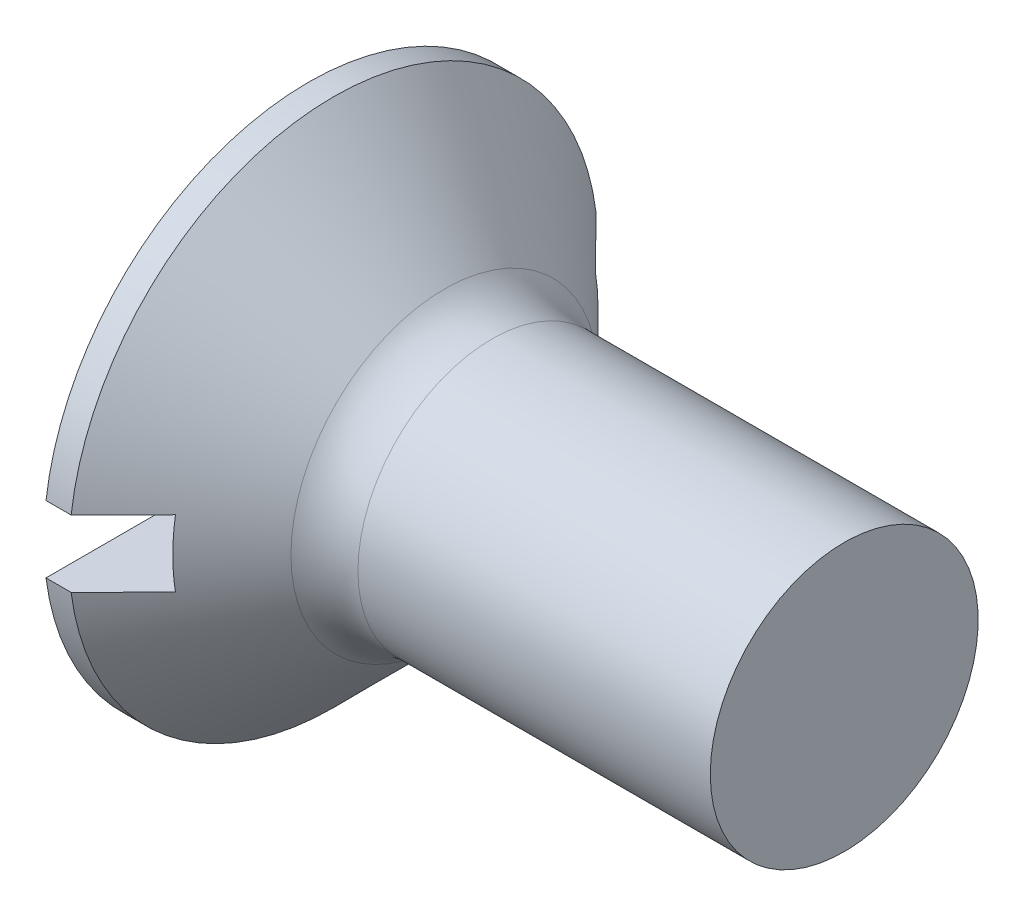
ISO-10303-21;
HEADER;
FILE_DESCRIPTION(('STEP AP214'),'2;1');
FILE_NAME('part.step','',(''),(''),'','','');
FILE_SCHEMA(('AUTOMOTIVE_DESIGN { 1 0 10303 214 1 1 1 1 }'));
ENDSEC;
DATA;
#1=APPLICATION_CONTEXT('core data for automotive mechanical design processes');
#2=APPLICATION_PROTOCOL_DEFINITION('international standard','automotive_design',2000,#1);
#3=PRODUCT_CONTEXT('',#1,'mechanical');
#4=PRODUCT('Part','Part','',(#3));
#5=PRODUCT_RELATED_PRODUCT_CATEGORY('part','',(#4));
#6=PRODUCT_DEFINITION_FORMATION('','',#4);
#7=PRODUCT_DEFINITION_CONTEXT('part definition',#1,'design');
#8=PRODUCT_DEFINITION('design','',#6,#7);
#9=PRODUCT_DEFINITION_SHAPE('','',#8);
#10=(LENGTH_UNIT() NAMED_UNIT(*) SI_UNIT(.MILLI.,.METRE.));
#11=(NAMED_UNIT(*) PLANE_ANGLE_UNIT() SI_UNIT($,.RADIAN.));
#12=(NAMED_UNIT(*) SI_UNIT($,.STERADIAN.) SOLID_ANGLE_UNIT());
#13=UNCERTAINTY_MEASURE_WITH_UNIT(LENGTH_MEASURE(1.E-05),#10,'distance_accuracy_value','');
#14=(GEOMETRIC_REPRESENTATION_CONTEXT(3) GLOBAL_UNCERTAINTY_ASSIGNED_CONTEXT((#13)) GLOBAL_UNIT_ASSIGNED_CONTEXT((#10,
#11,#12)) REPRESENTATION_CONTEXT('',''));
#15=CARTESIAN_POINT('',(0.,0.,0.));
#16=DIRECTION('',(0.,0.,1.));
#17=DIRECTION('',(1.,0.,0.));
#18=AXIS2_PLACEMENT_3D('',#15,#16,#17);
#19=CARTESIAN_POINT('',(0.,0.,0.));
#20=DIRECTION('',(-1.,0.,0.));
#21=DIRECTION('',(0.,0.,1.));
#22=AXIS2_PLACEMENT_3D('',#19,#20,#21);
#23=PLANE('',#22);
#24=DIRECTION('',(0.,0.,-1.));
#25=VECTOR('',#24,1.);
#26=CARTESIAN_POINT('',(0.,1.,7.90000000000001));
#27=LINE('',#26,#25);
#28=CARTESIAN_POINT('',(0.,0.999999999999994,7.83645327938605));
#29=VERTEX_POINT('',#28);
#30=CARTESIAN_POINT('',(0.,0.999999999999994,-7.83645327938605));
#31=VERTEX_POINT('',#30);
#32=EDGE_CURVE('E170',#29,#31,#27,.T.);
#33=ORIENTED_EDGE('',*,*,#32,.F.);
#34=CARTESIAN_POINT('',(0.,0.,0.));
#35=DIRECTION('',(-1.,0.,0.));
#36=DIRECTION('',(0.,0.,1.));
#37=AXIS2_PLACEMENT_3D('',#34,#35,#36);
#38=CIRCLE('',#37,7.9);
#39=EDGE_CURVE('E115',#29,#31,#38,.T.);
#40=ORIENTED_EDGE('',*,*,#39,.T.);
#41=EDGE_LOOP('',(#33,#40));
#42=FACE_BOUND('',#41,.T.);
#43=ADVANCED_FACE('F34',(#42),#23,.T.);
#44=CARTESIAN_POINT('',(-6.34999999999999,0.,0.));
#45=DIRECTION('',(-1.,0.,0.));
#46=DIRECTION('',(0.,0.,1.));
#47=AXIS2_PLACEMENT_3D('',#44,#45,#46);
#48=CYLINDRICAL_SURFACE('',#47,7.9);
#49=DIRECTION('',(-1.,0.,0.));
#50=VECTOR('',#49,1.);
#51=CARTESIAN_POINT('',(-6.34999999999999,0.999999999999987,-7.83645327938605));
#52=LINE('',#51,#50);
#53=CARTESIAN_POINT('',(0.750000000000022,0.999999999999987,-7.83645327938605));
#54=VERTEX_POINT('',#53);
#55=EDGE_CURVE('E62',#31,#54,#52,.F.);
#56=ORIENTED_EDGE('',*,*,#55,.F.);
#57=ORIENTED_EDGE('',*,*,#39,.F.);
#58=DIRECTION('',(-1.,0.,0.));
#59=VECTOR('',#58,1.);
#60=CARTESIAN_POINT('',(-6.34999999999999,0.999999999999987,7.83645327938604));
#61=LINE('',#60,#59);
#62=CARTESIAN_POINT('',(0.750000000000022,0.999999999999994,7.83645327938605));
#63=VERTEX_POINT('',#62);
#64=EDGE_CURVE('E176',#63,#29,#61,.T.);
#65=ORIENTED_EDGE('',*,*,#64,.F.);
#66=CARTESIAN_POINT('',(0.750000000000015,0.,0.));
#67=DIRECTION('',(-1.,0.,0.));
#68=DIRECTION('',(0.,0.,1.));
#69=AXIS2_PLACEMENT_3D('',#66,#67,#68);
#70=CIRCLE('',#69,7.9);
#71=EDGE_CURVE('E109',#63,#54,#70,.T.);
#72=ORIENTED_EDGE('',*,*,#71,.T.);
#73=EDGE_LOOP('',(#56,#57,#65,#72));
#74=FACE_BOUND('',#73,.T.);
#75=ADVANCED_FACE('F157',(#74),#48,.T.);
#76=DIRECTION('',(0.,0.,1.));
#77=VECTOR('',#76,1.);
#78=CARTESIAN_POINT('',(0.,-1.00000000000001,-7.90000000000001));
#79=LINE('',#78,#77);
#80=CARTESIAN_POINT('',(0.,-1.00000000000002,-7.83645327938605));
#81=VERTEX_POINT('',#80);
#82=CARTESIAN_POINT('',(0.,-1.00000000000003,7.83645327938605));
#83=VERTEX_POINT('',#82);
#84=EDGE_CURVE('E103',#81,#83,#79,.T.);
#85=ORIENTED_EDGE('',*,*,#84,.F.);
#86=EDGE_CURVE('E111',#81,#83,#38,.T.);
#87=ORIENTED_EDGE('',*,*,#86,.T.);
#88=EDGE_LOOP('',(#85,#87));
#89=FACE_BOUND('',#88,.T.);
#90=ADVANCED_FACE('F36',(#89),#23,.T.);
#91=DIRECTION('',(-1.,0.,0.));
#92=VECTOR('',#91,1.);
#93=CARTESIAN_POINT('',(-6.34999999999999,-1.00000000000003,7.83645327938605));
#94=LINE('',#93,#92);
#95=CARTESIAN_POINT('',(0.750000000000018,-1.00000000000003,7.83645327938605));
#96=VERTEX_POINT('',#95);
#97=EDGE_CURVE('E175',#83,#96,#94,.F.);
#98=ORIENTED_EDGE('',*,*,#97,.F.);
#99=ORIENTED_EDGE('',*,*,#86,.F.);
#100=DIRECTION('',(-1.,0.,0.));
#101=VECTOR('',#100,1.);
#102=CARTESIAN_POINT('',(-6.34999999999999,-1.00000000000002,-7.83645327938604));
#103=LINE('',#102,#101);
#104=CARTESIAN_POINT('',(0.750000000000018,-1.00000000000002,-7.83645327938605));
#105=VERTEX_POINT('',#104);
#106=EDGE_CURVE('E173',#105,#81,#103,.T.);
#107=ORIENTED_EDGE('',*,*,#106,.F.);
#108=EDGE_CURVE('E112',#105,#96,#70,.T.);
#109=ORIENTED_EDGE('',*,*,#108,.T.);
#110=EDGE_LOOP('',(#98,#99,#107,#109));
#111=FACE_BOUND('',#110,.T.);
#112=ADVANCED_FACE('F154',(#111),#48,.T.);
#113=CARTESIAN_POINT('',(0.750000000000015,0.,0.));
#114=DIRECTION('',(-1.,0.,0.));
#115=DIRECTION('',(0.,0.,1.));
#116=AXIS2_PLACEMENT_3D('',#113,#114,#115);
#117=CONICAL_SURFACE('',#116,7.9,0.78539816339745);
#118=CARTESIAN_POINT('',(-8.7757078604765,0.999999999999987,-17.3969909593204));
#119=CARTESIAN_POINT('',(-8.18516126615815,1.,-16.8054622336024));
#120=CARTESIAN_POINT('',(-7.59465740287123,1.00000000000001,-16.2138908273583));
#121=CARTESIAN_POINT('',(-6.41378164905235,1.00000000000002,-15.0306023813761));
#122=CARTESIAN_POINT('',(-5.82340976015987,1.00000000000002,-14.4388853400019));
#123=CARTESIAN_POINT('',(-4.64270263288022,1.00000000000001,-13.255103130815));
#124=CARTESIAN_POINT('',(-4.05236744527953,1.00000000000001,-12.6630379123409));
#125=CARTESIAN_POINT('',(-2.87199614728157,1.00000000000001,-11.478622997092));
#126=CARTESIAN_POINT('',(-2.28196003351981,1.00000000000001,-10.8862733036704));
#127=CARTESIAN_POINT('',(-1.08164284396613,1.00000000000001,-9.68031352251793));
#128=CARTESIAN_POINT('',(-0.471378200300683,1.00000000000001,-9.06668707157));
#129=CARTESIAN_POINT('',(0.44335636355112,1.00000000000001,-8.14556750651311));
#130=CARTESIAN_POINT('',(0.748162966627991,1.00000000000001,-7.83840880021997));
#131=CARTESIAN_POINT('',(1.35745269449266,1.00000000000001,-7.2237728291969));
#132=CARTESIAN_POINT('',(1.66193582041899,1.00000000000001,-6.91629556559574));
#133=CARTESIAN_POINT('',(2.27038024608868,1.00000000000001,-6.30092705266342));
#134=CARTESIAN_POINT('',(2.57434162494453,1.00000000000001,-5.99303588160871));
#135=CARTESIAN_POINT('',(3.18153118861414,1.00000000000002,-5.37652314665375));
#136=CARTESIAN_POINT('',(3.48475936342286,1.00000000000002,-5.06790157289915));
#137=CARTESIAN_POINT('',(4.0899815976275,1.00000000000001,-4.44948585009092));
#138=CARTESIAN_POINT('',(4.39197573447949,1.00000000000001,-4.13969177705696));
#139=CARTESIAN_POINT('',(4.84320779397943,1.00000000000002,-3.67330421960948));
#140=CARTESIAN_POINT('',(4.99332367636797,1.00000000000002,-3.51756065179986));
#141=CARTESIAN_POINT('',(5.29268613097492,1.00000000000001,-3.20524073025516));
#142=CARTESIAN_POINT('',(5.44193271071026,0.999999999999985,-3.04866438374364));
#143=CARTESIAN_POINT('',(5.63045968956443,1.00000000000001,-2.84917706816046));
#144=CARTESIAN_POINT('',(5.6703639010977,1.00000000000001,-2.8068555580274));
#145=CARTESIAN_POINT('',(5.7500596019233,1.00000000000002,-2.72210635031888));
#146=CARTESIAN_POINT('',(5.78985109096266,1.00000000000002,-2.67967865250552));
#147=CARTESIAN_POINT('',(5.90903474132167,1.00000000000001,-2.55221478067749));
#148=CARTESIAN_POINT('',(5.98823500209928,1.00000000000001,-2.46699897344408));
#149=CARTESIAN_POINT('',(6.14568357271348,1.00000000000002,-2.29623493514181));
#150=CARTESIAN_POINT('',(6.22393422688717,1.00000000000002,-2.21068887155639));
#151=CARTESIAN_POINT('',(6.37949659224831,1.00000000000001,-2.03875368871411));
#152=CARTESIAN_POINT('',(6.45680833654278,1.,-1.95236459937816));
#153=CARTESIAN_POINT('',(6.63613457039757,0.999999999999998,-1.74892660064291));
#154=CARTESIAN_POINT('',(6.737633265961,1.00000000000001,-1.6314172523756));
#155=CARTESIAN_POINT('',(6.8871116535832,1.00000000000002,-1.45218704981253));
#156=CARTESIAN_POINT('',(6.93662933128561,1.00000000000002,-1.39175212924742));
#157=CARTESIAN_POINT('',(7.03419733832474,1.00000000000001,-1.26971270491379));
#158=CARTESIAN_POINT('',(7.08224781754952,0.999999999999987,-1.20810832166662));
#159=CARTESIAN_POINT('',(7.17686733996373,0.999999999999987,-1.08252063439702));
#160=CARTESIAN_POINT('',(7.2234095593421,1.00000000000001,-1.01851697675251));
#161=CARTESIAN_POINT('',(7.31335312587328,1.00000000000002,-0.888176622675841));
#162=CARTESIAN_POINT('',(7.35675018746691,1.00000000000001,-0.821836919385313));
#163=CARTESIAN_POINT('',(7.43812345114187,1.00000000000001,-0.686691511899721));
#164=CARTESIAN_POINT('',(7.47614561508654,1.00000000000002,-0.617913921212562));
#165=CARTESIAN_POINT('',(7.54401836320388,1.00000000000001,-0.476459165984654));
#166=CARTESIAN_POINT('',(7.57389424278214,0.999999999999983,-0.40379493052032));
#167=CARTESIAN_POINT('',(7.60791308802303,0.999999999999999,-0.294944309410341));
#168=CARTESIAN_POINT('',(7.61721942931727,1.00000000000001,-0.260380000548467));
#169=CARTESIAN_POINT('',(7.63258158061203,1.00000000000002,-0.190525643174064));
#170=CARTESIAN_POINT('',(7.63863788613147,1.00000000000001,-0.155235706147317));
#171=CARTESIAN_POINT('',(7.64705688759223,1.00000000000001,-0.0844006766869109));
#172=CARTESIAN_POINT('',(7.64943916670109,1.00000000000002,-0.0488579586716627));
#173=CARTESIAN_POINT('',(7.65038424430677,1.00000000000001,0.0222800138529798));
#174=CARTESIAN_POINT('',(7.64894700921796,1.,0.0578752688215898));
#175=CARTESIAN_POINT('',(7.64238299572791,1.,0.128552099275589));
#176=CARTESIAN_POINT('',(7.63727307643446,1.00000000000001,0.163635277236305));
#177=CARTESIAN_POINT('',(7.62374500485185,1.00000000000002,0.233160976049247));
#178=CARTESIAN_POINT('',(7.61532539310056,1.00000000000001,0.267603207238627));
#179=CARTESIAN_POINT('',(7.5956047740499,1.00000000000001,0.335897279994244));
#180=CARTESIAN_POINT('',(7.58428427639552,1.00000000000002,0.36974340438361));
#181=CARTESIAN_POINT('',(7.55930701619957,1.00000000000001,0.43654346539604));
#182=CARTESIAN_POINT('',(7.54565060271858,1.,0.46949753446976));
#183=CARTESIAN_POINT('',(7.50553915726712,0.999999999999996,0.558913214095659));
#184=CARTESIAN_POINT('',(7.47715589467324,1.00000000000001,0.614505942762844));
#185=CARTESIAN_POINT('',(7.41651696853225,1.00000000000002,0.72355619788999));
#186=CARTESIAN_POINT('',(7.38425707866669,1.00000000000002,0.777011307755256));
#187=CARTESIAN_POINT('',(7.31697210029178,1.00000000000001,0.88238912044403));
#188=CARTESIAN_POINT('',(7.28193809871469,1.00000000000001,0.934306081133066));
#189=CARTESIAN_POINT('',(7.20998021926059,1.00000000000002,1.03681612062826));
#190=CARTESIAN_POINT('',(7.17305597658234,1.00000000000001,1.08740894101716));
#191=CARTESIAN_POINT('',(7.09749128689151,1.00000000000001,1.18802155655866));
#192=CARTESIAN_POINT('',(7.05883817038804,1.00000000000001,1.23803178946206));
#193=CARTESIAN_POINT('',(6.98048918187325,1.00000000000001,1.33723249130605));
#194=CARTESIAN_POINT('',(6.94079321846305,1.00000000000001,1.38642288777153));
#195=CARTESIAN_POINT('',(6.86070216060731,1.00000000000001,1.48403606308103));
#196=CARTESIAN_POINT('',(6.8203089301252,1.00000000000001,1.53246037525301));
#197=CARTESIAN_POINT('',(6.73890676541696,1.00000000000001,1.62878419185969));
#198=CARTESIAN_POINT('',(6.69789785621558,1.00000000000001,1.67668371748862));
#199=CARTESIAN_POINT('',(6.57588196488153,1.00000000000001,1.81773862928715));
#200=CARTESIAN_POINT('',(6.49418594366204,1.00000000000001,1.91029757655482));
#201=CARTESIAN_POINT('',(6.329556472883,1.00000000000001,2.09431001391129));
#202=CARTESIAN_POINT('',(6.24662296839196,1.00000000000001,2.18576345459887));
#203=CARTESIAN_POINT('',(6.07987521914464,1.00000000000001,2.36788566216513));
#204=CARTESIAN_POINT('',(5.99606085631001,1.00000000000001,2.45855432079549));
#205=CARTESIAN_POINT('',(5.82779726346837,1.00000000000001,2.6393011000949));
#206=CARTESIAN_POINT('',(5.74334802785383,1.00000000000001,2.72937921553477));
#207=CARTESIAN_POINT('',(5.48909525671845,1.00000000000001,2.99916221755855));
#208=CARTESIAN_POINT('',(5.31858510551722,1.00000000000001,3.17820072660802));
#209=CARTESIAN_POINT('',(4.97645275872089,1.00000000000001,3.53518102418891));
#210=CARTESIAN_POINT('',(4.80483065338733,1.00000000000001,3.71312289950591));
#211=CARTESIAN_POINT('',(4.46258776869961,1.00000000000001,4.06648936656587));
#212=CARTESIAN_POINT('',(4.29197445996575,1.00000000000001,4.24192119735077));
#213=CARTESIAN_POINT('',(3.95024230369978,1.00000000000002,4.59229847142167));
#214=CARTESIAN_POINT('',(3.77912344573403,1.00000000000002,4.7672439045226));
#215=CARTESIAN_POINT('',(3.2654014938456,1.00000000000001,5.29138528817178));
#216=CARTESIAN_POINT('',(2.92226544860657,0.999999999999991,5.64005869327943));
#217=CARTESIAN_POINT('',(2.11220114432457,0.999999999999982,6.46133420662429));
#218=CARTESIAN_POINT('',(1.6449402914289,1.00000000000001,6.93360785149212));
#219=CARTESIAN_POINT('',(0.70964044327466,1.00000000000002,7.87738661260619));
#220=CARTESIAN_POINT('',(0.241601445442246,1.00000000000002,8.34889172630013));
#221=CARTESIAN_POINT('',(-0.695043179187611,1.00000000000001,9.29153608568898));
#222=CARTESIAN_POINT('',(-1.16364890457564,1.00000000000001,9.76267523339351));
#223=CARTESIAN_POINT('',(-2.10116254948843,1.00000000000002,10.7046516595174));
#224=CARTESIAN_POINT('',(-2.57007046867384,1.00000000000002,11.1754889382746));
#225=CARTESIAN_POINT('',(-3.99470630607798,1.00000000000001,12.6053736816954));
#226=CARTESIAN_POINT('',(-4.95075208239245,1.00000000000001,13.5641044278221));
#227=CARTESIAN_POINT('',(-6.38503497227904,1.00000000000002,15.0017760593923));
#228=CARTESIAN_POINT('',(-6.86311229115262,1.00000000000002,15.4808764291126));
#229=CARTESIAN_POINT('',(-7.81935175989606,1.00000000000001,16.4389920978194));
#230=CARTESIAN_POINT('',(-8.29751390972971,1.00000000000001,16.9180073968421));
#231=CARTESIAN_POINT('',(-8.77570786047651,0.999999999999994,17.3969909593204));
#232=B_SPLINE_CURVE_WITH_KNOTS('',3,(#118,#119,#120,#121,#122,#123,#124,#125,#126,#127,#128,
#129,#130,#131,#132,#133,#134,#135,#136,#137,#138,#139,#140,#141,#142,#143,#144,#145,#146,#147,
#148,#149,#150,#151,#152,#153,#154,#155,#156,#157,#158,#159,#160,#161,#162,#163,#164,#165,#166,
#167,#168,#169,#170,#171,#172,#173,#174,#175,#176,#177,#178,#179,#180,#181,#182,#183,#184,#185,
#186,#187,#188,#189,#190,#191,#192,#193,#194,#195,#196,#197,#198,#199,#200,#201,#202,#203,#204,
#205,#206,#207,#208,#209,#210,#211,#212,#213,#214,#215,#216,#217,#218,#219,#220,#221,#222,#223,
#224,#225,#226,#227,#228,#229,#230,#231),.UNSPECIFIED.,.F.,.F.,(4,2,2,2,2,2,2,2,2,2,2,2,2,2,2,2,
2,2,2,2,2,2,2,2,2,2,2,2,2,2,2,2,2,2,2,2,2,2,2,2,2,2,2,2,2,2,2,2,2,2,2,2,2,2,2,2,4),(0.,
2.50756130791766,5.01515220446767,7.52340484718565,10.0316286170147,12.6279028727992,
13.9260867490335,15.2242660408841,16.5222271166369,17.8202058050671,19.1181017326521,
19.7670356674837,20.415963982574,20.5904662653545,20.7649689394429,21.1139790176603,
21.4617826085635,21.8095738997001,22.2753326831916,22.509709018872,22.7440613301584,
22.9814123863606,23.2190810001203,23.4545752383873,23.6893296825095,23.796587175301,
23.903828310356,24.0104958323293,24.1171642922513,24.2233462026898,24.3295749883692,
24.4365371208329,24.543483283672,24.7304856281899,24.9176937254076,25.1055298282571,
25.2934023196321,25.4830042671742,25.672622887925,25.8617955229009,26.0509604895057,
26.4213092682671,26.7916745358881,27.1620901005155,27.5325089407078,28.2742244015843,
29.0158803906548,29.7500225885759,30.4841800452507,31.9517737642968,33.9448542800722,
35.937941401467,37.9314483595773,39.9249530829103,43.9868111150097,46.0172927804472,
48.0477735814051),.UNSPECIFIED.);
#233=CARTESIAN_POINT('',(2.3,1.,6.27076550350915));
#234=VERTEX_POINT('',#233);
#235=EDGE_CURVE('E11',#234,#63,#232,.T.);
#236=ORIENTED_EDGE('',*,*,#235,.F.);
#237=CARTESIAN_POINT('',(2.3,0.,0.));
#238=DIRECTION('',(1.,0.,0.));
#239=DIRECTION('',(0.,0.,-1.));
#240=AXIS2_PLACEMENT_3D('',#237,#238,#239);
#241=CIRCLE('',#240,6.35000000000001);
#242=CARTESIAN_POINT('',(2.3,-1.00000000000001,6.27076550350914));
#243=VERTEX_POINT('',#242);
#244=EDGE_CURVE('E91',#243,#234,#241,.F.);
#245=ORIENTED_EDGE('',*,*,#244,.F.);
#246=CARTESIAN_POINT('',(-8.77570786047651,-1.00000000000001,17.3969909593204));
#247=CARTESIAN_POINT('',(-8.18516126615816,-1.,16.8054622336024));
#248=CARTESIAN_POINT('',(-7.59465740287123,-1.,16.2138908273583));
#249=CARTESIAN_POINT('',(-6.41378164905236,-1.,15.0306023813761));
#250=CARTESIAN_POINT('',(-5.82340976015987,-1.,14.4388853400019));
#251=CARTESIAN_POINT('',(-4.64270263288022,-1.,13.255103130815));
#252=CARTESIAN_POINT('',(-4.05236744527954,-1.,12.6630379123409));
#253=CARTESIAN_POINT('',(-2.87199614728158,-1.,11.478622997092));
#254=CARTESIAN_POINT('',(-2.28196003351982,-1.,10.8862733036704));
#255=CARTESIAN_POINT('',(-1.08164284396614,-1.,9.68031352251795));
#256=CARTESIAN_POINT('',(-0.471378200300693,-1.,9.06668707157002));
#257=CARTESIAN_POINT('',(0.443356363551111,-1.,8.14556750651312));
#258=CARTESIAN_POINT('',(0.748162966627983,-1.,7.83840880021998));
#259=CARTESIAN_POINT('',(1.35745269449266,-1.,7.22377282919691));
#260=CARTESIAN_POINT('',(1.66193582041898,-1.,6.91629556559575));
#261=CARTESIAN_POINT('',(2.27038024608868,-1.,6.30092705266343));
#262=CARTESIAN_POINT('',(2.57434162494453,-1.,5.99303588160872));
#263=CARTESIAN_POINT('',(3.18153118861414,-1.00000000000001,5.37652314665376));
#264=CARTESIAN_POINT('',(3.48475936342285,-1.00000000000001,5.06790157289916));
#265=CARTESIAN_POINT('',(4.0899815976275,-1.,4.44948585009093));
#266=CARTESIAN_POINT('',(4.39197573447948,-1.,4.13969177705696));
#267=CARTESIAN_POINT('',(4.84320779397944,-1.00000000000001,3.67330421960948));
#268=CARTESIAN_POINT('',(4.99332367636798,-1.00000000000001,3.51756065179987));
#269=CARTESIAN_POINT('',(5.29268613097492,-1.,3.20524073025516));
#270=CARTESIAN_POINT('',(5.44193271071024,-0.999999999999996,3.04866438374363));
#271=CARTESIAN_POINT('',(5.63045968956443,-1.,2.84917706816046));
#272=CARTESIAN_POINT('',(5.67036390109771,-1.,2.8068555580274));
#273=CARTESIAN_POINT('',(5.75005960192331,-1.00000000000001,2.72210635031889));
#274=CARTESIAN_POINT('',(5.78985109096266,-1.00000000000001,2.67967865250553));
#275=CARTESIAN_POINT('',(5.90903474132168,-1.00000000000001,2.5522147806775));
#276=CARTESIAN_POINT('',(5.98823500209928,-1.00000000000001,2.46699897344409));
#277=CARTESIAN_POINT('',(6.14568357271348,-1.00000000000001,2.29623493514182));
#278=CARTESIAN_POINT('',(6.22393422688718,-1.,2.21068887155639));
#279=CARTESIAN_POINT('',(6.37949659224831,-1.00000000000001,2.03875368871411));
#280=CARTESIAN_POINT('',(6.45680833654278,-1.00000000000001,1.95236459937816));
#281=CARTESIAN_POINT('',(6.63613457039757,-1.00000000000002,1.74892660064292));
#282=CARTESIAN_POINT('',(6.73763326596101,-1.00000000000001,1.63141725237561));
#283=CARTESIAN_POINT('',(6.88711165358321,-1.,1.45218704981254));
#284=CARTESIAN_POINT('',(6.93662933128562,-1.00000000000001,1.39175212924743));
#285=CARTESIAN_POINT('',(7.03419733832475,-1.00000000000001,1.26971270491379));
#286=CARTESIAN_POINT('',(7.08224781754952,-1.00000000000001,1.20810832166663));
#287=CARTESIAN_POINT('',(7.17686733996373,-1.00000000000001,1.08252063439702));
#288=CARTESIAN_POINT('',(7.22340955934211,-1.00000000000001,1.01851697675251));
#289=CARTESIAN_POINT('',(7.3133531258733,-1.00000000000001,0.888176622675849));
#290=CARTESIAN_POINT('',(7.35675018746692,-1.00000000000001,0.82183691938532));
#291=CARTESIAN_POINT('',(7.43812345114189,-1.00000000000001,0.686691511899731));
#292=CARTESIAN_POINT('',(7.47614561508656,-1.00000000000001,0.617913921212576));
#293=CARTESIAN_POINT('',(7.54401836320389,-1.00000000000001,0.476459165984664));
#294=CARTESIAN_POINT('',(7.57389424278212,-1.00000000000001,0.40379493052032));
#295=CARTESIAN_POINT('',(7.60791308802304,-1.00000000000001,0.294944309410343));
#296=CARTESIAN_POINT('',(7.61721942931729,-1.00000000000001,0.260380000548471));
#297=CARTESIAN_POINT('',(7.63258158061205,-1.00000000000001,0.190525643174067));
#298=CARTESIAN_POINT('',(7.63863788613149,-1.00000000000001,0.155235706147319));
#299=CARTESIAN_POINT('',(7.64705688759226,-1.00000000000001,0.0844006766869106));
#300=CARTESIAN_POINT('',(7.64943916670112,-1.00000000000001,0.0488579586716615));
#301=CARTESIAN_POINT('',(7.65038424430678,-1.,-0.0222800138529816));
#302=CARTESIAN_POINT('',(7.64894700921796,-1.,-0.0578752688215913));
#303=CARTESIAN_POINT('',(7.64238299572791,-1.,-0.128552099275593));
#304=CARTESIAN_POINT('',(7.63727307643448,-1.,-0.163635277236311));
#305=CARTESIAN_POINT('',(7.62374500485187,-1.00000000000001,-0.233160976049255));
#306=CARTESIAN_POINT('',(7.61532539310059,-1.00000000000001,-0.267603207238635));
#307=CARTESIAN_POINT('',(7.59560477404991,-1.00000000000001,-0.335897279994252));
#308=CARTESIAN_POINT('',(7.58428427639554,-1.00000000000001,-0.369743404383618));
#309=CARTESIAN_POINT('',(7.55930701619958,-1.00000000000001,-0.436543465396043));
#310=CARTESIAN_POINT('',(7.54565060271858,-1.00000000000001,-0.469497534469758));
#311=CARTESIAN_POINT('',(7.50553915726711,-1.00000000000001,-0.558913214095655));
#312=CARTESIAN_POINT('',(7.47715589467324,-1.00000000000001,-0.614505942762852));
#313=CARTESIAN_POINT('',(7.41651696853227,-1.00000000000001,-0.723556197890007));
#314=CARTESIAN_POINT('',(7.38425707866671,-1.00000000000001,-0.77701130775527));
#315=CARTESIAN_POINT('',(7.31697210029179,-1.00000000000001,-0.882389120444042));
#316=CARTESIAN_POINT('',(7.28193809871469,-1.00000000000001,-0.934306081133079));
#317=CARTESIAN_POINT('',(7.2099802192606,-1.00000000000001,-1.03681612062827));
#318=CARTESIAN_POINT('',(7.17305597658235,-1.00000000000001,-1.08740894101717));
#319=CARTESIAN_POINT('',(7.09749128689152,-1.00000000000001,-1.18802155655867));
#320=CARTESIAN_POINT('',(7.05883817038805,-1.00000000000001,-1.23803178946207));
#321=CARTESIAN_POINT('',(6.98048918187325,-1.00000000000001,-1.33723249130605));
#322=CARTESIAN_POINT('',(6.94079321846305,-1.00000000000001,-1.38642288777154));
#323=CARTESIAN_POINT('',(6.86070216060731,-1.00000000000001,-1.48403606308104));
#324=CARTESIAN_POINT('',(6.82030893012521,-1.00000000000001,-1.53246037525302));
#325=CARTESIAN_POINT('',(6.73890676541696,-1.00000000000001,-1.6287841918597));
#326=CARTESIAN_POINT('',(6.69789785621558,-1.00000000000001,-1.67668371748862));
#327=CARTESIAN_POINT('',(6.57588196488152,-1.00000000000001,-1.81773862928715));
#328=CARTESIAN_POINT('',(6.49418594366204,-1.00000000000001,-1.91029757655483));
#329=CARTESIAN_POINT('',(6.329556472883,-1.00000000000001,-2.0943100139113));
#330=CARTESIAN_POINT('',(6.24662296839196,-1.00000000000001,-2.18576345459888));
#331=CARTESIAN_POINT('',(6.07987521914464,-1.00000000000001,-2.36788566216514));
#332=CARTESIAN_POINT('',(5.99606085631,-1.00000000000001,-2.4585543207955));
#333=CARTESIAN_POINT('',(5.82779726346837,-1.00000000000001,-2.63930110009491));
#334=CARTESIAN_POINT('',(5.74334802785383,-1.00000000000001,-2.72937921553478));
#335=CARTESIAN_POINT('',(5.48909525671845,-1.00000000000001,-2.99916221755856));
#336=CARTESIAN_POINT('',(5.31858510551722,-1.00000000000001,-3.17820072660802));
#337=CARTESIAN_POINT('',(4.97645275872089,-1.00000000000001,-3.53518102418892));
#338=CARTESIAN_POINT('',(4.80483065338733,-1.00000000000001,-3.71312289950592));
#339=CARTESIAN_POINT('',(4.46258776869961,-1.00000000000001,-4.06648936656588));
#340=CARTESIAN_POINT('',(4.29197445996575,-1.00000000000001,-4.24192119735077));
#341=CARTESIAN_POINT('',(3.95024230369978,-1.00000000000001,-4.59229847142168));
#342=CARTESIAN_POINT('',(3.77912344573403,-1.00000000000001,-4.7672439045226));
#343=CARTESIAN_POINT('',(3.2654014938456,-1.00000000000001,-5.29138528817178));
#344=CARTESIAN_POINT('',(2.92226544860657,-1.00000000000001,-5.64005869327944));
#345=CARTESIAN_POINT('',(2.11220114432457,-1.00000000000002,-6.4613342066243));
#346=CARTESIAN_POINT('',(1.64494029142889,-1.00000000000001,-6.93360785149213));
#347=CARTESIAN_POINT('',(0.70964044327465,-1.00000000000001,-7.8773866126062));
#348=CARTESIAN_POINT('',(0.241601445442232,-1.00000000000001,-8.34889172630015));
#349=CARTESIAN_POINT('',(-0.695043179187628,-1.00000000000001,-9.291536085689));
#350=CARTESIAN_POINT('',(-1.16364890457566,-1.00000000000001,-9.76267523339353));
#351=CARTESIAN_POINT('',(-2.10116254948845,-1.00000000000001,-10.7046516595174));
#352=CARTESIAN_POINT('',(-2.57007046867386,-1.00000000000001,-11.1754889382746));
#353=CARTESIAN_POINT('',(-3.99470630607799,-1.00000000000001,-12.6053736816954));
#354=CARTESIAN_POINT('',(-4.95075208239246,-1.00000000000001,-13.5641044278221));
#355=CARTESIAN_POINT('',(-6.38503497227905,-1.00000000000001,-15.0017760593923));
#356=CARTESIAN_POINT('',(-6.86311229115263,-1.00000000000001,-15.4808764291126));
#357=CARTESIAN_POINT('',(-7.81935175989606,-1.00000000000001,-16.4389920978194));
#358=CARTESIAN_POINT('',(-8.29751390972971,-1.00000000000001,-16.9180073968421));
#359=CARTESIAN_POINT('',(-8.77570786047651,-1.00000000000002,-17.3969909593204));
#360=B_SPLINE_CURVE_WITH_KNOTS('',3,(#246,#247,#248,#249,#250,#251,#252,#253,#254,#255,#256,
#257,#258,#259,#260,#261,#262,#263,#264,#265,#266,#267,#268,#269,#270,#271,#272,#273,#274,#275,
#276,#277,#278,#279,#280,#281,#282,#283,#284,#285,#286,#287,#288,#289,#290,#291,#292,#293,#294,
#295,#296,#297,#298,#299,#300,#301,#302,#303,#304,#305,#306,#307,#308,#309,#310,#311,#312,#313,
#314,#315,#316,#317,#318,#319,#320,#321,#322,#323,#324,#325,#326,#327,#328,#329,#330,#331,#332,
#333,#334,#335,#336,#337,#338,#339,#340,#341,#342,#343,#344,#345,#346,#347,#348,#349,#350,#351,
#352,#353,#354,#355,#356,#357,#358,#359),.UNSPECIFIED.,.F.,.F.,(4,2,2,2,2,2,2,2,2,2,2,2,2,2,2,2,
2,2,2,2,2,2,2,2,2,2,2,2,2,2,2,2,2,2,2,2,2,2,2,2,2,2,2,2,2,2,2,2,2,2,2,2,2,2,2,2,4),(0.,
2.50756130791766,5.01515220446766,7.52340484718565,10.0316286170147,12.6279028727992,
13.9260867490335,15.2242660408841,16.5222271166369,17.8202058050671,19.1181017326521,
19.7670356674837,20.415963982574,20.5904662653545,20.7649689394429,21.1139790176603,
21.4617826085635,21.8095738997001,22.2753326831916,22.509709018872,22.7440613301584,
22.9814123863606,23.2190810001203,23.4545752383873,23.6893296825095,23.796587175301,
23.903828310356,24.0104958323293,24.1171642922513,24.2233462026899,24.3295749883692,
24.4365371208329,24.543483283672,24.73048562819,24.9176937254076,25.1055298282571,
25.2934023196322,25.4830042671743,25.6726228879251,25.8617955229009,26.0509604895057,
26.4213092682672,26.7916745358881,27.1620901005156,27.5325089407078,28.2742244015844,
29.0158803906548,29.7500225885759,30.4841800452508,31.9517737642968,33.9448542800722,
35.937941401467,37.9314483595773,39.9249530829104,43.9868111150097,46.0172927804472,
48.0477735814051),.UNSPECIFIED.);
#361=EDGE_CURVE('E48',#96,#243,#360,.T.);
#362=ORIENTED_EDGE('',*,*,#361,.F.);
#363=ORIENTED_EDGE('',*,*,#108,.F.);
#364=CARTESIAN_POINT('',(2.30000000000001,-1.00000000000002,-6.27076550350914));
#365=VERTEX_POINT('',#364);
#366=EDGE_CURVE('E127',#365,#105,#360,.T.);
#367=ORIENTED_EDGE('',*,*,#366,.F.);
#368=CARTESIAN_POINT('',(2.30000000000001,0.999999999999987,-6.27076550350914));
#369=VERTEX_POINT('',#368);
#370=EDGE_CURVE('E99',#369,#365,#241,.F.);
#371=ORIENTED_EDGE('',*,*,#370,.F.);
#372=EDGE_CURVE('E38',#54,#369,#232,.T.);
#373=ORIENTED_EDGE('',*,*,#372,.F.);
#374=ORIENTED_EDGE('',*,*,#71,.F.);
#375=EDGE_LOOP('',(#236,#245,#362,#363,#367,#371,#373,#374));
#376=FACE_BOUND('',#375,.T.);
#377=CARTESIAN_POINT('',(4.0642135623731,0.,0.));
#378=DIRECTION('',(-1.,0.,0.));
#379=DIRECTION('',(0.,0.,1.));
#380=AXIS2_PLACEMENT_3D('',#377,#378,#379);
#381=CIRCLE('',#380,4.58578643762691);
#382=CARTESIAN_POINT('',(4.0642135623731,0.,4.58578643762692));
#383=VERTEX_POINT('',#382);
#384=EDGE_CURVE('E122',#383,#383,#381,.T.);
#385=ORIENTED_EDGE('',*,*,#384,.T.);
#386=EDGE_LOOP('',(#385));
#387=FACE_BOUND('',#386,.T.);
#388=ADVANCED_FACE('F106',(#376,#387),#117,.T.);
#389=CARTESIAN_POINT('',(-6.34999999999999,0.,0.));
#390=DIRECTION('',(-1.,0.,0.));
#391=DIRECTION('',(0.,0.,1.));
#392=AXIS2_PLACEMENT_3D('',#389,#390,#391);
#393=CYLINDRICAL_SURFACE('',#392,4.);
#394=CARTESIAN_POINT('',(5.47842712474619,0.,0.));
#395=DIRECTION('',(-1.,0.,0.));
#396=DIRECTION('',(0.,0.,1.));
#397=AXIS2_PLACEMENT_3D('',#394,#395,#396);
#398=CIRCLE('',#397,4.);
#399=CARTESIAN_POINT('',(5.47842712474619,0.,4.00000000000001));
#400=VERTEX_POINT('',#399);
#401=EDGE_CURVE('E125',#400,#400,#398,.F.);
#402=ORIENTED_EDGE('',*,*,#401,.T.);
#403=EDGE_LOOP('',(#402));
#404=FACE_BOUND('',#403,.T.);
#405=CARTESIAN_POINT('',(16.,0.,0.));
#406=DIRECTION('',(-1.,0.,0.));
#407=DIRECTION('',(0.,0.,1.));
#408=AXIS2_PLACEMENT_3D('',#405,#406,#407);
#409=CIRCLE('',#408,4.);
#410=CARTESIAN_POINT('',(16.,0.,4.00000000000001));
#411=VERTEX_POINT('',#410);
#412=EDGE_CURVE('E118',#411,#411,#409,.T.);
#413=ORIENTED_EDGE('',*,*,#412,.T.);
#414=EDGE_LOOP('',(#413));
#415=FACE_BOUND('',#414,.T.);
#416=ADVANCED_FACE('F148',(#404,#415),#393,.T.);
#417=CARTESIAN_POINT('',(16.,4.,0.));
#418=DIRECTION('',(1.,0.,0.));
#419=DIRECTION('',(0.,0.,-1.));
#420=AXIS2_PLACEMENT_3D('',#417,#418,#419);
#421=PLANE('',#420);
#422=ORIENTED_EDGE('',*,*,#412,.F.);
#423=EDGE_LOOP('',(#422));
#424=FACE_BOUND('',#423,.T.);
#425=ADVANCED_FACE('F145',(#424),#421,.T.);
#426=CARTESIAN_POINT('',(5.47842712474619,0.,0.));
#427=DIRECTION('',(-1.,0.,0.));
#428=DIRECTION('',(0.,0.,1.));
#429=AXIS2_PLACEMENT_3D('',#426,#427,#428);
#430=TOROIDAL_SURFACE('',#429,6.,2.);
#431=ORIENTED_EDGE('',*,*,#401,.F.);
#432=EDGE_LOOP('',(#431));
#433=FACE_BOUND('',#432,.T.);
#434=ORIENTED_EDGE('',*,*,#384,.F.);
#435=EDGE_LOOP('',(#434));
#436=FACE_BOUND('',#435,.T.);
#437=ADVANCED_FACE('F142',(#433,#436),#430,.F.);
#438=CARTESIAN_POINT('',(2.3,1.00000000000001,7.90000000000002));
#439=DIRECTION('',(0.,1.,0.));
#440=DIRECTION('',(0.,0.,1.));
#441=AXIS2_PLACEMENT_3D('',#438,#439,#440);
#442=PLANE('',#441);
#443=ORIENTED_EDGE('',*,*,#55,.T.);
#444=ORIENTED_EDGE('',*,*,#372,.T.);
#445=DIRECTION('',(0.,0.,-1.));
#446=VECTOR('',#445,1.);
#447=CARTESIAN_POINT('',(2.3,1.00000000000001,7.90000000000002));
#448=LINE('',#447,#446);
#449=EDGE_CURVE('E55',#234,#369,#448,.T.);
#450=ORIENTED_EDGE('',*,*,#449,.F.);
#451=ORIENTED_EDGE('',*,*,#235,.T.);
#452=ORIENTED_EDGE('',*,*,#64,.T.);
#453=ORIENTED_EDGE('',*,*,#32,.T.);
#454=EDGE_LOOP('',(#443,#444,#450,#451,#452,#453));
#455=FACE_BOUND('',#454,.T.);
#456=ADVANCED_FACE('F100',(#455),#442,.F.);
#457=CARTESIAN_POINT('',(2.3,-1.00000000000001,-7.90000000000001));
#458=DIRECTION('',(0.,-1.,0.));
#459=DIRECTION('',(0.,0.,-1.));
#460=AXIS2_PLACEMENT_3D('',#457,#458,#459);
#461=PLANE('',#460);
#462=ORIENTED_EDGE('',*,*,#97,.T.);
#463=ORIENTED_EDGE('',*,*,#361,.T.);
#464=DIRECTION('',(0.,0.,1.));
#465=VECTOR('',#464,1.);
#466=CARTESIAN_POINT('',(2.3,-1.00000000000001,-7.90000000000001));
#467=LINE('',#466,#465);
#468=EDGE_CURVE('E94',#365,#243,#467,.T.);
#469=ORIENTED_EDGE('',*,*,#468,.F.);
#470=ORIENTED_EDGE('',*,*,#366,.T.);
#471=ORIENTED_EDGE('',*,*,#106,.T.);
#472=ORIENTED_EDGE('',*,*,#84,.T.);
#473=EDGE_LOOP('',(#462,#463,#469,#470,#471,#472));
#474=FACE_BOUND('',#473,.T.);
#475=ADVANCED_FACE('F134',(#474),#461,.F.);
#476=CARTESIAN_POINT('',(2.3,-1.00000000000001,-7.90000000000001));
#477=DIRECTION('',(1.,0.,0.));
#478=DIRECTION('',(0.,0.,-1.));
#479=AXIS2_PLACEMENT_3D('',#476,#477,#478);
#480=PLANE('',#479);
#481=ORIENTED_EDGE('',*,*,#244,.T.);
#482=ORIENTED_EDGE('',*,*,#449,.T.);
#483=ORIENTED_EDGE('',*,*,#370,.T.);
#484=ORIENTED_EDGE('',*,*,#468,.T.);
#485=EDGE_LOOP('',(#481,#482,#483,#484));
#486=FACE_BOUND('',#485,.T.);
#487=ADVANCED_FACE('F92',(#486),#480,.F.);
#488=CLOSED_SHELL('',(#43,#75,#90,#112,#388,#416,#425,#437,#456,#475,#487));
#489=MANIFOLD_SOLID_BREP('B2',#488);
#490=ADVANCED_BREP_SHAPE_REPRESENTATION('',(#18,#489),#14);
#491=SHAPE_DEFINITION_REPRESENTATION(#9,#490);
ENDSEC;
END-ISO-10303-21;
